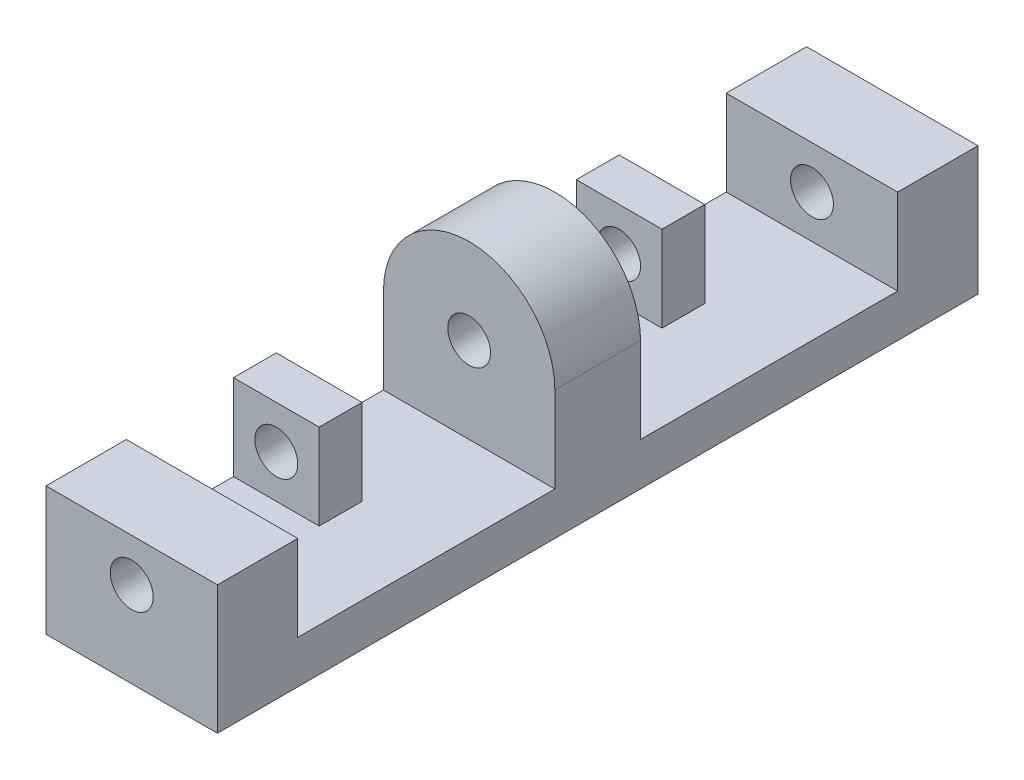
ISO-10303-21;
HEADER;
FILE_DESCRIPTION(('STEP AP214'),'2;1');
FILE_NAME('part.step','',(''),(''),'','','');
FILE_SCHEMA(('AUTOMOTIVE_DESIGN { 1 0 10303 214 1 1 1 1 }'));
ENDSEC;
DATA;
#1=APPLICATION_CONTEXT('core data for automotive mechanical design processes');
#2=APPLICATION_PROTOCOL_DEFINITION('international standard','automotive_design',2000,#1);
#3=PRODUCT_CONTEXT('',#1,'mechanical');
#4=PRODUCT('Part','Part','',(#3));
#5=PRODUCT_RELATED_PRODUCT_CATEGORY('part','',(#4));
#6=PRODUCT_DEFINITION_FORMATION('','',#4);
#7=PRODUCT_DEFINITION_CONTEXT('part definition',#1,'design');
#8=PRODUCT_DEFINITION('design','',#6,#7);
#9=PRODUCT_DEFINITION_SHAPE('','',#8);
#10=(LENGTH_UNIT() NAMED_UNIT(*) SI_UNIT(.MILLI.,.METRE.));
#11=(NAMED_UNIT(*) PLANE_ANGLE_UNIT() SI_UNIT($,.RADIAN.));
#12=(NAMED_UNIT(*) SI_UNIT($,.STERADIAN.) SOLID_ANGLE_UNIT());
#13=UNCERTAINTY_MEASURE_WITH_UNIT(LENGTH_MEASURE(1.E-05),#10,'distance_accuracy_value','');
#14=(GEOMETRIC_REPRESENTATION_CONTEXT(3) GLOBAL_UNCERTAINTY_ASSIGNED_CONTEXT((#13)) GLOBAL_UNIT_ASSIGNED_CONTEXT((#10,
#11,#12)) REPRESENTATION_CONTEXT('',''));
#15=CARTESIAN_POINT('',(0.,0.,0.));
#16=DIRECTION('',(0.,0.,1.));
#17=DIRECTION('',(1.,0.,0.));
#18=AXIS2_PLACEMENT_3D('',#15,#16,#17);
#19=CARTESIAN_POINT('',(0.,12.7,201.6125));
#20=DIRECTION('',(0.,-1.,0.));
#21=DIRECTION('',(0.,0.,-1.));
#22=AXIS2_PLACEMENT_3D('',#19,#20,#21);
#23=PLANE('',#22);
#24=DIRECTION('',(-1.,0.,0.));
#25=VECTOR('',#24,1.);
#26=CARTESIAN_POINT('',(25.4,12.7,169.8625));
#27=LINE('',#26,#25);
#28=CARTESIAN_POINT('',(25.4,12.7,169.8625));
#29=VERTEX_POINT('',#28);
#30=CARTESIAN_POINT('',(0.,12.7,169.8625));
#31=VERTEX_POINT('',#30);
#32=EDGE_CURVE('E195',#29,#31,#27,.T.);
#33=ORIENTED_EDGE('',*,*,#32,.T.);
#34=DIRECTION('',(0.,0.,-1.));
#35=VECTOR('',#34,1.);
#36=CARTESIAN_POINT('',(0.,12.7,201.6125));
#37=LINE('',#36,#35);
#38=CARTESIAN_POINT('',(0.,12.7,201.6125));
#39=VERTEX_POINT('',#38);
#40=EDGE_CURVE('E299',#39,#31,#37,.T.);
#41=ORIENTED_EDGE('',*,*,#40,.F.);
#42=DIRECTION('',(1.,0.,0.));
#43=VECTOR('',#42,1.);
#44=CARTESIAN_POINT('',(0.,12.7,201.6125));
#45=LINE('',#44,#43);
#46=CARTESIAN_POINT('',(50.8,12.7,201.6125));
#47=VERTEX_POINT('',#46);
#48=EDGE_CURVE('E310',#39,#47,#45,.T.);
#49=ORIENTED_EDGE('',*,*,#48,.T.);
#50=DIRECTION('',(0.,0.,-1.));
#51=VECTOR('',#50,1.);
#52=CARTESIAN_POINT('',(50.8,12.7,201.6125));
#53=LINE('',#52,#51);
#54=CARTESIAN_POINT('',(50.8,12.7,125.4125));
#55=VERTEX_POINT('',#54);
#56=EDGE_CURVE('E311',#47,#55,#53,.T.);
#57=ORIENTED_EDGE('',*,*,#56,.T.);
#58=DIRECTION('',(1.,0.,0.));
#59=VECTOR('',#58,1.);
#60=CARTESIAN_POINT('',(50.8,12.7,125.4125));
#61=LINE('',#60,#59);
#62=CARTESIAN_POINT('',(0.,12.7,125.4125));
#63=VERTEX_POINT('',#62);
#64=EDGE_CURVE('E275',#63,#55,#61,.T.);
#65=ORIENTED_EDGE('',*,*,#64,.F.);
#66=CARTESIAN_POINT('',(0.,12.7,157.1625));
#67=VERTEX_POINT('',#66);
#68=EDGE_CURVE('E303',#67,#63,#37,.T.);
#69=ORIENTED_EDGE('',*,*,#68,.F.);
#70=DIRECTION('',(-1.,0.,0.));
#71=VECTOR('',#70,1.);
#72=CARTESIAN_POINT('',(25.4,12.7,157.1625));
#73=LINE('',#72,#71);
#74=CARTESIAN_POINT('',(25.4,12.7,157.1625));
#75=VERTEX_POINT('',#74);
#76=EDGE_CURVE('E217',#75,#67,#73,.T.);
#77=ORIENTED_EDGE('',*,*,#76,.F.);
#78=DIRECTION('',(0.,0.,-1.));
#79=VECTOR('',#78,1.);
#80=CARTESIAN_POINT('',(25.4,12.7,169.8625));
#81=LINE('',#80,#79);
#82=EDGE_CURVE('E199',#29,#75,#81,.T.);
#83=ORIENTED_EDGE('',*,*,#82,.F.);
#84=EDGE_LOOP('',(#33,#41,#49,#57,#65,#69,#77,#83));
#85=FACE_BOUND('',#84,.T.);
#86=ADVANCED_FACE('F43',(#85),#23,.F.);
#87=DIRECTION('',(-1.,0.,0.));
#88=VECTOR('',#87,1.);
#89=CARTESIAN_POINT('',(25.4,12.7,68.2625));
#90=LINE('',#89,#88);
#91=CARTESIAN_POINT('',(25.4,12.7,68.2625));
#92=VERTEX_POINT('',#91);
#93=CARTESIAN_POINT('',(0.,12.7,68.2625));
#94=VERTEX_POINT('',#93);
#95=EDGE_CURVE('E250',#92,#94,#90,.T.);
#96=ORIENTED_EDGE('',*,*,#95,.T.);
#97=CARTESIAN_POINT('',(0.,12.7,100.0125));
#98=VERTEX_POINT('',#97);
#99=EDGE_CURVE('E302',#98,#94,#37,.T.);
#100=ORIENTED_EDGE('',*,*,#99,.F.);
#101=DIRECTION('',(-1.,0.,0.));
#102=VECTOR('',#101,1.);
#103=CARTESIAN_POINT('',(50.8,12.7,100.0125));
#104=LINE('',#103,#102);
#105=CARTESIAN_POINT('',(50.8,12.7,100.0125));
#106=VERTEX_POINT('',#105);
#107=EDGE_CURVE('E269',#106,#98,#104,.T.);
#108=ORIENTED_EDGE('',*,*,#107,.F.);
#109=CARTESIAN_POINT('',(50.8,12.7,23.8125));
#110=VERTEX_POINT('',#109);
#111=EDGE_CURVE('E309',#106,#110,#53,.T.);
#112=ORIENTED_EDGE('',*,*,#111,.T.);
#113=DIRECTION('',(1.,0.,0.));
#114=VECTOR('',#113,1.);
#115=CARTESIAN_POINT('',(0.,12.7,23.8125));
#116=LINE('',#115,#114);
#117=CARTESIAN_POINT('',(0.,12.7,23.8125));
#118=VERTEX_POINT('',#117);
#119=EDGE_CURVE('E322',#118,#110,#116,.T.);
#120=ORIENTED_EDGE('',*,*,#119,.F.);
#121=CARTESIAN_POINT('',(0.,12.7,55.5625));
#122=VERTEX_POINT('',#121);
#123=EDGE_CURVE('E300',#122,#118,#37,.T.);
#124=ORIENTED_EDGE('',*,*,#123,.F.);
#125=DIRECTION('',(-1.,0.,0.));
#126=VECTOR('',#125,1.);
#127=CARTESIAN_POINT('',(25.4,12.7,55.5625));
#128=LINE('',#127,#126);
#129=CARTESIAN_POINT('',(25.4,12.7,55.5625));
#130=VERTEX_POINT('',#129);
#131=EDGE_CURVE('E244',#130,#122,#128,.T.);
#132=ORIENTED_EDGE('',*,*,#131,.F.);
#133=DIRECTION('',(0.,0.,1.));
#134=VECTOR('',#133,1.);
#135=CARTESIAN_POINT('',(25.4,12.7,55.5625));
#136=LINE('',#135,#134);
#137=EDGE_CURVE('E235',#130,#92,#136,.T.);
#138=ORIENTED_EDGE('',*,*,#137,.T.);
#139=EDGE_LOOP('',(#96,#100,#108,#112,#120,#124,#132,#138));
#140=FACE_BOUND('',#139,.T.);
#141=ADVANCED_FACE('F380',(#140),#23,.F.);
#142=CARTESIAN_POINT('',(50.8,0.,225.425));
#143=DIRECTION('',(-1.,0.,0.));
#144=DIRECTION('',(0.,0.,1.));
#145=AXIS2_PLACEMENT_3D('',#142,#143,#144);
#146=PLANE('',#145);
#147=DIRECTION('',(0.,0.,1.));
#148=VECTOR('',#147,1.);
#149=CARTESIAN_POINT('',(50.8,38.1,-199.542692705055));
#150=LINE('',#149,#148);
#151=CARTESIAN_POINT('',(50.8,38.1,100.0125));
#152=VERTEX_POINT('',#151);
#153=CARTESIAN_POINT('',(50.8,38.1,125.4125));
#154=VERTEX_POINT('',#153);
#155=EDGE_CURVE('E251',#152,#154,#150,.T.);
#156=ORIENTED_EDGE('',*,*,#155,.T.);
#157=DIRECTION('',(0.,-1.,0.));
#158=VECTOR('',#157,1.);
#159=CARTESIAN_POINT('',(50.8,63.5,125.4125));
#160=LINE('',#159,#158);
#161=EDGE_CURVE('E273',#154,#55,#160,.T.);
#162=ORIENTED_EDGE('',*,*,#161,.T.);
#163=ORIENTED_EDGE('',*,*,#56,.F.);
#164=DIRECTION('',(0.,-1.,0.));
#165=VECTOR('',#164,1.);
#166=CARTESIAN_POINT('',(50.8,38.1,201.6125));
#167=LINE('',#166,#165);
#168=CARTESIAN_POINT('',(50.8,38.1,201.6125));
#169=VERTEX_POINT('',#168);
#170=EDGE_CURVE('E291',#169,#47,#167,.T.);
#171=ORIENTED_EDGE('',*,*,#170,.F.);
#172=DIRECTION('',(0.,0.,-1.));
#173=VECTOR('',#172,1.);
#174=CARTESIAN_POINT('',(50.8,38.1,225.425));
#175=LINE('',#174,#173);
#176=CARTESIAN_POINT('',(50.8,38.1,225.425));
#177=VERTEX_POINT('',#176);
#178=EDGE_CURVE('E348',#177,#169,#175,.T.);
#179=ORIENTED_EDGE('',*,*,#178,.F.);
#180=DIRECTION('',(0.,1.,0.));
#181=VECTOR('',#180,1.);
#182=CARTESIAN_POINT('',(50.8,0.,225.425));
#183=LINE('',#182,#181);
#184=CARTESIAN_POINT('',(50.8,0.,225.425));
#185=VERTEX_POINT('',#184);
#186=EDGE_CURVE('E333',#185,#177,#183,.T.);
#187=ORIENTED_EDGE('',*,*,#186,.F.);
#188=DIRECTION('',(0.,0.,-1.));
#189=VECTOR('',#188,1.);
#190=CARTESIAN_POINT('',(50.8,0.,225.425));
#191=LINE('',#190,#189);
#192=CARTESIAN_POINT('',(50.8,0.,0.));
#193=VERTEX_POINT('',#192);
#194=EDGE_CURVE('E55',#185,#193,#191,.T.);
#195=ORIENTED_EDGE('',*,*,#194,.T.);
#196=DIRECTION('',(0.,1.,0.));
#197=VECTOR('',#196,1.);
#198=CARTESIAN_POINT('',(50.8,0.,0.));
#199=LINE('',#198,#197);
#200=CARTESIAN_POINT('',(50.8,38.1,0.));
#201=VERTEX_POINT('',#200);
#202=EDGE_CURVE('E338',#193,#201,#199,.T.);
#203=ORIENTED_EDGE('',*,*,#202,.T.);
#204=CARTESIAN_POINT('',(50.8,38.1,23.8125));
#205=VERTEX_POINT('',#204);
#206=EDGE_CURVE('E347',#205,#201,#175,.T.);
#207=ORIENTED_EDGE('',*,*,#206,.F.);
#208=DIRECTION('',(0.,1.,0.));
#209=VECTOR('',#208,1.);
#210=CARTESIAN_POINT('',(50.8,38.1,23.8125));
#211=LINE('',#210,#209);
#212=EDGE_CURVE('E296',#110,#205,#211,.T.);
#213=ORIENTED_EDGE('',*,*,#212,.F.);
#214=ORIENTED_EDGE('',*,*,#111,.F.);
#215=DIRECTION('',(0.,-1.,0.));
#216=VECTOR('',#215,1.);
#217=CARTESIAN_POINT('',(50.8,63.5,100.0125));
#218=LINE('',#217,#216);
#219=EDGE_CURVE('E285',#152,#106,#218,.T.);
#220=ORIENTED_EDGE('',*,*,#219,.F.);
#221=EDGE_LOOP('',(#156,#162,#163,#171,#179,#187,#195,#203,#207,#213,#214,#220));
#222=FACE_BOUND('',#221,.T.);
#223=ADVANCED_FACE('F357',(#222),#146,.F.);
#224=CARTESIAN_POINT('',(0.,38.1,225.425));
#225=DIRECTION('',(0.,-1.,0.));
#226=DIRECTION('',(0.,0.,-1.));
#227=AXIS2_PLACEMENT_3D('',#224,#225,#226);
#228=PLANE('',#227);
#229=ORIENTED_EDGE('',*,*,#178,.T.);
#230=DIRECTION('',(1.,0.,0.));
#231=VECTOR('',#230,1.);
#232=CARTESIAN_POINT('',(0.,38.1,201.6125));
#233=LINE('',#232,#231);
#234=CARTESIAN_POINT('',(0.,38.1,201.6125));
#235=VERTEX_POINT('',#234);
#236=EDGE_CURVE('E314',#235,#169,#233,.T.);
#237=ORIENTED_EDGE('',*,*,#236,.F.);
#238=DIRECTION('',(0.,0.,-1.));
#239=VECTOR('',#238,1.);
#240=CARTESIAN_POINT('',(0.,38.1,225.425));
#241=LINE('',#240,#239);
#242=CARTESIAN_POINT('',(0.,38.1,225.425));
#243=VERTEX_POINT('',#242);
#244=EDGE_CURVE('E343',#243,#235,#241,.T.);
#245=ORIENTED_EDGE('',*,*,#244,.F.);
#246=DIRECTION('',(-1.,0.,0.));
#247=VECTOR('',#246,1.);
#248=CARTESIAN_POINT('',(0.,38.1,225.425));
#249=LINE('',#248,#247);
#250=EDGE_CURVE('E331',#177,#243,#249,.T.);
#251=ORIENTED_EDGE('',*,*,#250,.F.);
#252=EDGE_LOOP('',(#229,#237,#245,#251));
#253=FACE_BOUND('',#252,.T.);
#254=ADVANCED_FACE('F405',(#253),#228,.F.);
#255=CARTESIAN_POINT('',(0.,0.,225.425));
#256=DIRECTION('',(1.,0.,0.));
#257=DIRECTION('',(0.,0.,-1.));
#258=AXIS2_PLACEMENT_3D('',#255,#256,#257);
#259=PLANE('',#258);
#260=DIRECTION('',(0.,-1.,0.));
#261=VECTOR('',#260,1.);
#262=CARTESIAN_POINT('',(0.,63.5,125.4125));
#263=LINE('',#262,#261);
#264=CARTESIAN_POINT('',(0.,38.1,125.4125));
#265=VERTEX_POINT('',#264);
#266=EDGE_CURVE('E280',#265,#63,#263,.T.);
#267=ORIENTED_EDGE('',*,*,#266,.F.);
#268=DIRECTION('',(0.,0.,1.));
#269=VECTOR('',#268,1.);
#270=CARTESIAN_POINT('',(0.,38.1,-199.542692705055));
#271=LINE('',#270,#269);
#272=CARTESIAN_POINT('',(0.,38.1,100.0125));
#273=VERTEX_POINT('',#272);
#274=EDGE_CURVE('E254',#273,#265,#271,.T.);
#275=ORIENTED_EDGE('',*,*,#274,.F.);
#276=DIRECTION('',(0.,-1.,0.));
#277=VECTOR('',#276,1.);
#278=CARTESIAN_POINT('',(0.,63.5,100.0125));
#279=LINE('',#278,#277);
#280=EDGE_CURVE('E278',#273,#98,#279,.T.);
#281=ORIENTED_EDGE('',*,*,#280,.T.);
#282=ORIENTED_EDGE('',*,*,#99,.T.);
#283=DIRECTION('',(0.,-1.,0.));
#284=VECTOR('',#283,1.);
#285=CARTESIAN_POINT('',(0.,38.1,68.2625));
#286=LINE('',#285,#284);
#287=CARTESIAN_POINT('',(0.,38.1,68.2625));
#288=VERTEX_POINT('',#287);
#289=EDGE_CURVE('E241',#288,#94,#286,.T.);
#290=ORIENTED_EDGE('',*,*,#289,.F.);
#291=DIRECTION('',(0.,0.,1.));
#292=VECTOR('',#291,1.);
#293=CARTESIAN_POINT('',(0.,38.1,55.5625));
#294=LINE('',#293,#292);
#295=CARTESIAN_POINT('',(0.,38.1,55.5625));
#296=VERTEX_POINT('',#295);
#297=EDGE_CURVE('E228',#296,#288,#294,.T.);
#298=ORIENTED_EDGE('',*,*,#297,.F.);
#299=DIRECTION('',(0.,-1.,0.));
#300=VECTOR('',#299,1.);
#301=CARTESIAN_POINT('',(0.,38.1,55.5625));
#302=LINE('',#301,#300);
#303=EDGE_CURVE('E66',#296,#122,#302,.T.);
#304=ORIENTED_EDGE('',*,*,#303,.T.);
#305=ORIENTED_EDGE('',*,*,#123,.T.);
#306=DIRECTION('',(0.,1.,0.));
#307=VECTOR('',#306,1.);
#308=CARTESIAN_POINT('',(0.,38.1,23.8125));
#309=LINE('',#308,#307);
#310=CARTESIAN_POINT('',(0.,38.1,23.8125));
#311=VERTEX_POINT('',#310);
#312=EDGE_CURVE('E305',#118,#311,#309,.T.);
#313=ORIENTED_EDGE('',*,*,#312,.T.);
#314=CARTESIAN_POINT('',(0.,38.1,0.));
#315=VERTEX_POINT('',#314);
#316=EDGE_CURVE('E332',#311,#315,#241,.T.);
#317=ORIENTED_EDGE('',*,*,#316,.T.);
#318=DIRECTION('',(0.,-1.,0.));
#319=VECTOR('',#318,1.);
#320=CARTESIAN_POINT('',(0.,0.,0.));
#321=LINE('',#320,#319);
#322=CARTESIAN_POINT('',(0.,0.,0.));
#323=VERTEX_POINT('',#322);
#324=EDGE_CURVE('E320',#315,#323,#321,.T.);
#325=ORIENTED_EDGE('',*,*,#324,.T.);
#326=DIRECTION('',(0.,0.,-1.));
#327=VECTOR('',#326,1.);
#328=CARTESIAN_POINT('',(0.,0.,225.425));
#329=LINE('',#328,#327);
#330=CARTESIAN_POINT('',(0.,0.,225.425));
#331=VERTEX_POINT('',#330);
#332=EDGE_CURVE('E11',#331,#323,#329,.T.);
#333=ORIENTED_EDGE('',*,*,#332,.F.);
#334=DIRECTION('',(0.,-1.,0.));
#335=VECTOR('',#334,1.);
#336=CARTESIAN_POINT('',(0.,0.,225.425));
#337=LINE('',#336,#335);
#338=EDGE_CURVE('E323',#243,#331,#337,.T.);
#339=ORIENTED_EDGE('',*,*,#338,.F.);
#340=ORIENTED_EDGE('',*,*,#244,.T.);
#341=DIRECTION('',(0.,-1.,0.));
#342=VECTOR('',#341,1.);
#343=CARTESIAN_POINT('',(0.,38.1,201.6125));
#344=LINE('',#343,#342);
#345=EDGE_CURVE('E295',#235,#39,#344,.T.);
#346=ORIENTED_EDGE('',*,*,#345,.T.);
#347=ORIENTED_EDGE('',*,*,#40,.T.);
#348=DIRECTION('',(0.,-1.,0.));
#349=VECTOR('',#348,1.);
#350=CARTESIAN_POINT('',(0.,38.1,169.8625));
#351=LINE('',#350,#349);
#352=CARTESIAN_POINT('',(0.,38.1,169.8625));
#353=VERTEX_POINT('',#352);
#354=EDGE_CURVE('E207',#353,#31,#351,.T.);
#355=ORIENTED_EDGE('',*,*,#354,.F.);
#356=DIRECTION('',(0.,0.,-1.));
#357=VECTOR('',#356,1.);
#358=CARTESIAN_POINT('',(0.,38.1,169.8625));
#359=LINE('',#358,#357);
#360=CARTESIAN_POINT('',(0.,38.1,157.1625));
#361=VERTEX_POINT('',#360);
#362=EDGE_CURVE('E189',#353,#361,#359,.T.);
#363=ORIENTED_EDGE('',*,*,#362,.T.);
#364=DIRECTION('',(0.,-1.,0.));
#365=VECTOR('',#364,1.);
#366=CARTESIAN_POINT('',(0.,38.1,157.1625));
#367=LINE('',#366,#365);
#368=EDGE_CURVE('E56',#361,#67,#367,.T.);
#369=ORIENTED_EDGE('',*,*,#368,.T.);
#370=ORIENTED_EDGE('',*,*,#68,.T.);
#371=EDGE_LOOP('',(#267,#275,#281,#282,#290,#298,#304,#305,#313,#317,#325,#333,#339,#340,#346,
#347,#355,#363,#369,#370));
#372=FACE_BOUND('',#371,.T.);
#373=ADVANCED_FACE('F44',(#372),#259,.F.);
#374=CARTESIAN_POINT('',(0.,0.,225.425));
#375=DIRECTION('',(0.,1.,0.));
#376=DIRECTION('',(0.,0.,1.));
#377=AXIS2_PLACEMENT_3D('',#374,#375,#376);
#378=PLANE('',#377);
#379=DIRECTION('',(1.,0.,0.));
#380=VECTOR('',#379,1.);
#381=CARTESIAN_POINT('',(0.,0.,0.));
#382=LINE('',#381,#380);
#383=EDGE_CURVE('E336',#323,#193,#382,.T.);
#384=ORIENTED_EDGE('',*,*,#383,.T.);
#385=ORIENTED_EDGE('',*,*,#194,.F.);
#386=DIRECTION('',(1.,0.,0.));
#387=VECTOR('',#386,1.);
#388=CARTESIAN_POINT('',(0.,0.,225.425));
#389=LINE('',#388,#387);
#390=EDGE_CURVE('E327',#331,#185,#389,.T.);
#391=ORIENTED_EDGE('',*,*,#390,.F.);
#392=ORIENTED_EDGE('',*,*,#332,.T.);
#393=EDGE_LOOP('',(#384,#385,#391,#392));
#394=FACE_BOUND('',#393,.T.);
#395=ADVANCED_FACE('F409',(#394),#378,.F.);
#396=ORIENTED_EDGE('',*,*,#316,.F.);
#397=DIRECTION('',(1.,0.,0.));
#398=VECTOR('',#397,1.);
#399=CARTESIAN_POINT('',(0.,38.1,23.8125));
#400=LINE('',#399,#398);
#401=EDGE_CURVE('E319',#311,#205,#400,.T.);
#402=ORIENTED_EDGE('',*,*,#401,.T.);
#403=ORIENTED_EDGE('',*,*,#206,.T.);
#404=DIRECTION('',(-1.,0.,0.));
#405=VECTOR('',#404,1.);
#406=CARTESIAN_POINT('',(0.,38.1,0.));
#407=LINE('',#406,#405);
#408=EDGE_CURVE('E328',#201,#315,#407,.T.);
#409=ORIENTED_EDGE('',*,*,#408,.T.);
#410=EDGE_LOOP('',(#396,#402,#403,#409));
#411=FACE_BOUND('',#410,.T.);
#412=ADVANCED_FACE('F370',(#411),#228,.F.);
#413=CARTESIAN_POINT('',(0.,38.1,225.425));
#414=DIRECTION('',(0.,0.,-1.));
#415=DIRECTION('',(-1.,0.,0.));
#416=AXIS2_PLACEMENT_3D('',#413,#414,#415);
#417=PLANE('',#416);
#418=CARTESIAN_POINT('',(25.4,25.4,225.425));
#419=DIRECTION('',(0.,0.,1.));
#420=DIRECTION('',(1.,0.,0.));
#421=AXIS2_PLACEMENT_3D('',#418,#419,#420);
#422=CIRCLE('',#421,6.35);
#423=CARTESIAN_POINT('',(31.75,25.4,225.425));
#424=VERTEX_POINT('',#423);
#425=EDGE_CURVE('E283',#424,#424,#422,.T.);
#426=ORIENTED_EDGE('',*,*,#425,.F.);
#427=EDGE_LOOP('',(#426));
#428=FACE_BOUND('',#427,.T.);
#429=ORIENTED_EDGE('',*,*,#338,.T.);
#430=ORIENTED_EDGE('',*,*,#390,.T.);
#431=ORIENTED_EDGE('',*,*,#186,.T.);
#432=ORIENTED_EDGE('',*,*,#250,.T.);
#433=EDGE_LOOP('',(#429,#430,#431,#432));
#434=FACE_BOUND('',#433,.T.);
#435=ADVANCED_FACE('F407',(#428,#434),#417,.F.);
#436=CARTESIAN_POINT('',(0.,38.1,0.));
#437=DIRECTION('',(0.,0.,-1.));
#438=DIRECTION('',(-1.,0.,0.));
#439=AXIS2_PLACEMENT_3D('',#436,#437,#438);
#440=PLANE('',#439);
#441=CARTESIAN_POINT('',(25.4,25.4,0.));
#442=DIRECTION('',(0.,0.,1.));
#443=DIRECTION('',(1.,0.,0.));
#444=AXIS2_PLACEMENT_3D('',#441,#442,#443);
#445=CIRCLE('',#444,6.35);
#446=CARTESIAN_POINT('',(31.75,25.4,0.));
#447=VERTEX_POINT('',#446);
#448=EDGE_CURVE('E284',#447,#447,#445,.T.);
#449=ORIENTED_EDGE('',*,*,#448,.T.);
#450=EDGE_LOOP('',(#449));
#451=FACE_BOUND('',#450,.T.);
#452=ORIENTED_EDGE('',*,*,#324,.F.);
#453=ORIENTED_EDGE('',*,*,#408,.F.);
#454=ORIENTED_EDGE('',*,*,#202,.F.);
#455=ORIENTED_EDGE('',*,*,#383,.F.);
#456=EDGE_LOOP('',(#452,#453,#454,#455));
#457=FACE_BOUND('',#456,.T.);
#458=ADVANCED_FACE('F364',(#451,#457),#440,.T.);
#459=CARTESIAN_POINT('',(0.,38.1,201.6125));
#460=DIRECTION('',(0.,0.,1.));
#461=DIRECTION('',(1.,0.,0.));
#462=AXIS2_PLACEMENT_3D('',#459,#460,#461);
#463=PLANE('',#462);
#464=CARTESIAN_POINT('',(25.4,25.4,201.6125));
#465=DIRECTION('',(0.,0.,1.));
#466=DIRECTION('',(1.,0.,0.));
#467=AXIS2_PLACEMENT_3D('',#464,#465,#466);
#468=CIRCLE('',#467,6.35);
#469=CARTESIAN_POINT('',(31.75,25.4,201.6125));
#470=VERTEX_POINT('',#469);
#471=EDGE_CURVE('E287',#470,#470,#468,.T.);
#472=ORIENTED_EDGE('',*,*,#471,.T.);
#473=EDGE_LOOP('',(#472));
#474=FACE_BOUND('',#473,.T.);
#475=ORIENTED_EDGE('',*,*,#170,.T.);
#476=ORIENTED_EDGE('',*,*,#48,.F.);
#477=ORIENTED_EDGE('',*,*,#345,.F.);
#478=ORIENTED_EDGE('',*,*,#236,.T.);
#479=EDGE_LOOP('',(#475,#476,#477,#478));
#480=FACE_BOUND('',#479,.T.);
#481=ADVANCED_FACE('F434',(#474,#480),#463,.F.);
#482=CARTESIAN_POINT('',(0.,38.1,23.8125));
#483=DIRECTION('',(0.,0.,-1.));
#484=DIRECTION('',(-1.,0.,0.));
#485=AXIS2_PLACEMENT_3D('',#482,#483,#484);
#486=PLANE('',#485);
#487=CARTESIAN_POINT('',(25.4,25.4,23.8125));
#488=DIRECTION('',(0.,0.,-1.));
#489=DIRECTION('',(-1.,0.,0.));
#490=AXIS2_PLACEMENT_3D('',#487,#488,#489);
#491=CIRCLE('',#490,6.35);
#492=CARTESIAN_POINT('',(31.75,25.4,23.8125));
#493=VERTEX_POINT('',#492);
#494=EDGE_CURVE('E50',#493,#493,#491,.T.);
#495=ORIENTED_EDGE('',*,*,#494,.T.);
#496=EDGE_LOOP('',(#495));
#497=FACE_BOUND('',#496,.T.);
#498=ORIENTED_EDGE('',*,*,#212,.T.);
#499=ORIENTED_EDGE('',*,*,#401,.F.);
#500=ORIENTED_EDGE('',*,*,#312,.F.);
#501=ORIENTED_EDGE('',*,*,#119,.T.);
#502=EDGE_LOOP('',(#498,#499,#500,#501));
#503=FACE_BOUND('',#502,.T.);
#504=ADVANCED_FACE('F375',(#497,#503),#486,.F.);
#505=CARTESIAN_POINT('',(25.4,25.4,0.));
#506=DIRECTION('',(0.,0.,1.));
#507=DIRECTION('',(1.,0.,0.));
#508=AXIS2_PLACEMENT_3D('',#505,#506,#507);
#509=CYLINDRICAL_SURFACE('',#508,6.35);
#510=CARTESIAN_POINT('',(31.75,25.4,0.));
#511=CARTESIAN_POINT('',(31.75,25.4,0.248046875));
#512=CARTESIAN_POINT('',(31.75,25.4,0.49609375));
#513=CARTESIAN_POINT('',(31.75,25.4,0.9921875));
#514=CARTESIAN_POINT('',(31.75,25.4,1.240234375));
#515=CARTESIAN_POINT('',(31.75,25.4,1.736328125));
#516=CARTESIAN_POINT('',(31.75,25.4,1.984375));
#517=CARTESIAN_POINT('',(31.75,25.4,2.48046875));
#518=CARTESIAN_POINT('',(31.75,25.4,2.728515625));
#519=CARTESIAN_POINT('',(31.75,25.4,3.224609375));
#520=CARTESIAN_POINT('',(31.75,25.4,3.47265625));
#521=CARTESIAN_POINT('',(31.75,25.4,3.96875));
#522=CARTESIAN_POINT('',(31.75,25.4,4.216796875));
#523=CARTESIAN_POINT('',(31.75,25.4,4.712890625));
#524=CARTESIAN_POINT('',(31.75,25.4,4.9609375));
#525=CARTESIAN_POINT('',(31.75,25.4,5.45703125));
#526=CARTESIAN_POINT('',(31.75,25.4,5.705078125));
#527=CARTESIAN_POINT('',(31.75,25.4,6.201171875));
#528=CARTESIAN_POINT('',(31.75,25.4,6.44921875));
#529=CARTESIAN_POINT('',(31.75,25.4,6.9453125));
#530=CARTESIAN_POINT('',(31.75,25.4,7.193359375));
#531=CARTESIAN_POINT('',(31.75,25.4,7.689453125));
#532=CARTESIAN_POINT('',(31.75,25.4,7.9375));
#533=CARTESIAN_POINT('',(31.75,25.4,8.43359375));
#534=CARTESIAN_POINT('',(31.75,25.4,8.681640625));
#535=CARTESIAN_POINT('',(31.75,25.4,9.177734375));
#536=CARTESIAN_POINT('',(31.75,25.4,9.42578125));
#537=CARTESIAN_POINT('',(31.75,25.4,9.92187499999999));
#538=CARTESIAN_POINT('',(31.75,25.4,10.169921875));
#539=CARTESIAN_POINT('',(31.75,25.4,10.666015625));
#540=CARTESIAN_POINT('',(31.75,25.4,10.9140625));
#541=CARTESIAN_POINT('',(31.75,25.4,11.41015625));
#542=CARTESIAN_POINT('',(31.75,25.4,11.658203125));
#543=CARTESIAN_POINT('',(31.75,25.4,12.154296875));
#544=CARTESIAN_POINT('',(31.75,25.4,12.40234375));
#545=CARTESIAN_POINT('',(31.75,25.4,12.8984375));
#546=CARTESIAN_POINT('',(31.75,25.4,13.146484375));
#547=CARTESIAN_POINT('',(31.75,25.4,13.642578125));
#548=CARTESIAN_POINT('',(31.75,25.4,13.890625));
#549=CARTESIAN_POINT('',(31.75,25.4,14.38671875));
#550=CARTESIAN_POINT('',(31.75,25.4,14.634765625));
#551=CARTESIAN_POINT('',(31.75,25.4,15.130859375));
#552=CARTESIAN_POINT('',(31.75,25.4,15.37890625));
#553=CARTESIAN_POINT('',(31.75,25.4,15.875));
#554=CARTESIAN_POINT('',(31.75,25.4,16.123046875));
#555=CARTESIAN_POINT('',(31.75,25.4,16.619140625));
#556=CARTESIAN_POINT('',(31.75,25.4,16.8671875));
#557=CARTESIAN_POINT('',(31.75,25.4,17.36328125));
#558=CARTESIAN_POINT('',(31.75,25.4,17.611328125));
#559=CARTESIAN_POINT('',(31.75,25.4,18.107421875));
#560=CARTESIAN_POINT('',(31.75,25.4,18.35546875));
#561=CARTESIAN_POINT('',(31.75,25.4,18.8515625));
#562=CARTESIAN_POINT('',(31.75,25.4,19.099609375));
#563=CARTESIAN_POINT('',(31.75,25.4,19.595703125));
#564=CARTESIAN_POINT('',(31.75,25.4,19.84375));
#565=CARTESIAN_POINT('',(31.75,25.4,20.33984375));
#566=CARTESIAN_POINT('',(31.75,25.4,20.587890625));
#567=CARTESIAN_POINT('',(31.75,25.4,21.083984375));
#568=CARTESIAN_POINT('',(31.75,25.4,21.33203125));
#569=CARTESIAN_POINT('',(31.75,25.4,21.828125));
#570=CARTESIAN_POINT('',(31.75,25.4,22.076171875));
#571=CARTESIAN_POINT('',(31.75,25.4,22.572265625));
#572=CARTESIAN_POINT('',(31.75,25.4,22.8203125));
#573=CARTESIAN_POINT('',(31.75,25.4,23.31640625));
#574=CARTESIAN_POINT('',(31.75,25.4,23.564453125));
#575=CARTESIAN_POINT('',(31.75,25.4,23.8125));
#576=B_SPLINE_CURVE_WITH_KNOTS('',3,(#510,#511,#512,#513,#514,#515,#516,#517,#518,#519,#520,
#521,#522,#523,#524,#525,#526,#527,#528,#529,#530,#531,#532,#533,#534,#535,#536,#537,#538,#539,
#540,#541,#542,#543,#544,#545,#546,#547,#548,#549,#550,#551,#552,#553,#554,#555,#556,#557,#558,
#559,#560,#561,#562,#563,#564,#565,#566,#567,#568,#569,#570,#571,#572,#573,#574,#575),
.UNSPECIFIED.,.F.,.F.,(4,2,2,2,2,2,2,2,2,2,2,2,2,2,2,2,2,2,2,2,2,2,2,2,2,2,2,2,2,2,2,2,4),(0.,
0.744140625,1.48828125,2.232421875,2.9765625,3.720703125,4.46484375,5.208984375,5.953125,
6.697265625,7.44140625,8.185546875,8.9296875,9.67382812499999,10.41796875,11.162109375,11.90625,
12.650390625,13.39453125,14.138671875,14.8828125,15.626953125,16.37109375,17.115234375,
17.859375,18.603515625,19.34765625,20.091796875,20.8359375,21.580078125,22.32421875,
23.068359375,23.8125),.UNSPECIFIED.);
#577=EDGE_CURVE('BSEAM481',#447,#493,#576,.T.);
#578=ORIENTED_EDGE('',*,*,#448,.F.);
#579=ORIENTED_EDGE('',*,*,#494,.F.);
#580=ORIENTED_EDGE('',*,*,#577,.T.);
#581=ORIENTED_EDGE('',*,*,#577,.F.);
#582=EDGE_LOOP('',(#578,#580,#579,#581));
#583=FACE_BOUND('',#582,.T.);
#584=ADVANCED_FACE('F481',(#583),#509,.F.);
#585=CARTESIAN_POINT('',(31.75,25.4,225.425));
#586=CARTESIAN_POINT('',(31.75,25.4,225.176953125));
#587=CARTESIAN_POINT('',(31.75,25.4,224.92890625));
#588=CARTESIAN_POINT('',(31.75,25.4,224.4328125));
#589=CARTESIAN_POINT('',(31.75,25.4,224.184765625));
#590=CARTESIAN_POINT('',(31.75,25.4,223.688671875));
#591=CARTESIAN_POINT('',(31.75,25.4,223.440625));
#592=CARTESIAN_POINT('',(31.75,25.4,222.94453125));
#593=CARTESIAN_POINT('',(31.75,25.4,222.696484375));
#594=CARTESIAN_POINT('',(31.75,25.4,222.200390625));
#595=CARTESIAN_POINT('',(31.75,25.4,221.95234375));
#596=CARTESIAN_POINT('',(31.75,25.4,221.45625));
#597=CARTESIAN_POINT('',(31.75,25.4,221.208203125));
#598=CARTESIAN_POINT('',(31.75,25.4,220.712109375));
#599=CARTESIAN_POINT('',(31.75,25.4,220.4640625));
#600=CARTESIAN_POINT('',(31.75,25.4,219.96796875));
#601=CARTESIAN_POINT('',(31.75,25.4,219.719921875));
#602=CARTESIAN_POINT('',(31.75,25.4,219.223828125));
#603=CARTESIAN_POINT('',(31.75,25.4,218.97578125));
#604=CARTESIAN_POINT('',(31.75,25.4,218.4796875));
#605=CARTESIAN_POINT('',(31.75,25.4,218.231640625));
#606=CARTESIAN_POINT('',(31.75,25.4,217.735546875));
#607=CARTESIAN_POINT('',(31.75,25.4,217.4875));
#608=CARTESIAN_POINT('',(31.75,25.4,216.99140625));
#609=CARTESIAN_POINT('',(31.75,25.4,216.743359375));
#610=CARTESIAN_POINT('',(31.75,25.4,216.247265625));
#611=CARTESIAN_POINT('',(31.75,25.4,215.99921875));
#612=CARTESIAN_POINT('',(31.75,25.4,215.503125));
#613=CARTESIAN_POINT('',(31.75,25.4,215.255078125));
#614=CARTESIAN_POINT('',(31.75,25.4,214.758984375));
#615=CARTESIAN_POINT('',(31.75,25.4,214.5109375));
#616=CARTESIAN_POINT('',(31.75,25.4,214.01484375));
#617=CARTESIAN_POINT('',(31.75,25.4,213.766796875));
#618=CARTESIAN_POINT('',(31.75,25.4,213.270703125));
#619=CARTESIAN_POINT('',(31.75,25.4,213.02265625));
#620=CARTESIAN_POINT('',(31.75,25.4,212.5265625));
#621=CARTESIAN_POINT('',(31.75,25.4,212.278515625));
#622=CARTESIAN_POINT('',(31.75,25.4,211.782421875));
#623=CARTESIAN_POINT('',(31.75,25.4,211.534375));
#624=CARTESIAN_POINT('',(31.75,25.4,211.03828125));
#625=CARTESIAN_POINT('',(31.75,25.4,210.790234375));
#626=CARTESIAN_POINT('',(31.75,25.4,210.294140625));
#627=CARTESIAN_POINT('',(31.75,25.4,210.04609375));
#628=CARTESIAN_POINT('',(31.75,25.4,209.55));
#629=CARTESIAN_POINT('',(31.75,25.4,209.301953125));
#630=CARTESIAN_POINT('',(31.75,25.4,208.805859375));
#631=CARTESIAN_POINT('',(31.75,25.4,208.5578125));
#632=CARTESIAN_POINT('',(31.75,25.4,208.06171875));
#633=CARTESIAN_POINT('',(31.75,25.4,207.813671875));
#634=CARTESIAN_POINT('',(31.75,25.4,207.317578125));
#635=CARTESIAN_POINT('',(31.75,25.4,207.06953125));
#636=CARTESIAN_POINT('',(31.75,25.4,206.5734375));
#637=CARTESIAN_POINT('',(31.75,25.4,206.325390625));
#638=CARTESIAN_POINT('',(31.75,25.4,205.829296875));
#639=CARTESIAN_POINT('',(31.75,25.4,205.58125));
#640=CARTESIAN_POINT('',(31.75,25.4,205.08515625));
#641=CARTESIAN_POINT('',(31.75,25.4,204.837109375));
#642=CARTESIAN_POINT('',(31.75,25.4,204.341015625));
#643=CARTESIAN_POINT('',(31.75,25.4,204.09296875));
#644=CARTESIAN_POINT('',(31.75,25.4,203.596875));
#645=CARTESIAN_POINT('',(31.75,25.4,203.348828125));
#646=CARTESIAN_POINT('',(31.75,25.4,202.852734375));
#647=CARTESIAN_POINT('',(31.75,25.4,202.6046875));
#648=CARTESIAN_POINT('',(31.75,25.4,202.10859375));
#649=CARTESIAN_POINT('',(31.75,25.4,201.860546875));
#650=CARTESIAN_POINT('',(31.75,25.4,201.6125));
#651=B_SPLINE_CURVE_WITH_KNOTS('',3,(#585,#586,#587,#588,#589,#590,#591,#592,#593,#594,#595,
#596,#597,#598,#599,#600,#601,#602,#603,#604,#605,#606,#607,#608,#609,#610,#611,#612,#613,#614,
#615,#616,#617,#618,#619,#620,#621,#622,#623,#624,#625,#626,#627,#628,#629,#630,#631,#632,#633,
#634,#635,#636,#637,#638,#639,#640,#641,#642,#643,#644,#645,#646,#647,#648,#649,#650),
.UNSPECIFIED.,.F.,.F.,(4,2,2,2,2,2,2,2,2,2,2,2,2,2,2,2,2,2,2,2,2,2,2,2,2,2,2,2,2,2,2,2,4),(0.,
0.744140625,1.48828125,2.232421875,2.9765625,3.720703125,4.46484375,5.208984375,5.953125,
6.697265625,7.44140625,8.18554687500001,8.92968750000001,9.67382812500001,10.41796875,
11.162109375,11.90625,12.650390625,13.39453125,14.138671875,14.8828125,15.626953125,16.37109375,
17.115234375,17.859375,18.603515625,19.34765625,20.091796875,20.8359375,21.580078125,
22.32421875,23.068359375,23.8125),.UNSPECIFIED.);
#652=EDGE_CURVE('BSEAM493',#424,#470,#651,.T.);
#653=ORIENTED_EDGE('',*,*,#425,.T.);
#654=ORIENTED_EDGE('',*,*,#471,.F.);
#655=ORIENTED_EDGE('',*,*,#652,.T.);
#656=ORIENTED_EDGE('',*,*,#652,.F.);
#657=EDGE_LOOP('',(#653,#655,#654,#656));
#658=FACE_BOUND('',#657,.T.);
#659=ADVANCED_FACE('F493',(#658),#509,.F.);
#660=CARTESIAN_POINT('',(50.8,63.5,100.0125));
#661=DIRECTION('',(0.,0.,1.));
#662=DIRECTION('',(1.,0.,0.));
#663=AXIS2_PLACEMENT_3D('',#660,#661,#662);
#664=PLANE('',#663);
#665=CARTESIAN_POINT('',(25.4,38.1,100.0125));
#666=DIRECTION('',(0.,0.,1.));
#667=DIRECTION('',(1.,0.,0.));
#668=AXIS2_PLACEMENT_3D('',#665,#666,#667);
#669=CIRCLE('',#668,6.35000000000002);
#670=CARTESIAN_POINT('',(31.75,38.1,100.0125));
#671=VERTEX_POINT('',#670);
#672=EDGE_CURVE('E268',#671,#671,#669,.F.);
#673=ORIENTED_EDGE('',*,*,#672,.F.);
#674=EDGE_LOOP('',(#673));
#675=FACE_BOUND('',#674,.T.);
#676=ORIENTED_EDGE('',*,*,#280,.F.);
#677=CARTESIAN_POINT('',(25.4,38.1,100.0125));
#678=DIRECTION('',(0.,0.,1.));
#679=DIRECTION('',(1.,0.,0.));
#680=AXIS2_PLACEMENT_3D('',#677,#678,#679);
#681=CIRCLE('',#680,25.4);
#682=EDGE_CURVE('E261',#273,#152,#681,.F.);
#683=ORIENTED_EDGE('',*,*,#682,.T.);
#684=ORIENTED_EDGE('',*,*,#219,.T.);
#685=ORIENTED_EDGE('',*,*,#107,.T.);
#686=EDGE_LOOP('',(#676,#683,#684,#685));
#687=FACE_BOUND('',#686,.T.);
#688=ADVANCED_FACE('F381',(#675,#687),#664,.F.);
#689=CARTESIAN_POINT('',(50.8,63.5,125.4125));
#690=DIRECTION('',(0.,0.,-1.));
#691=DIRECTION('',(-1.,0.,0.));
#692=AXIS2_PLACEMENT_3D('',#689,#690,#691);
#693=PLANE('',#692);
#694=CARTESIAN_POINT('',(25.4,38.1,125.4125));
#695=DIRECTION('',(0.,0.,1.));
#696=DIRECTION('',(1.,0.,0.));
#697=AXIS2_PLACEMENT_3D('',#694,#695,#696);
#698=CIRCLE('',#697,6.35000000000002);
#699=CARTESIAN_POINT('',(31.75,38.1,125.4125));
#700=VERTEX_POINT('',#699);
#701=EDGE_CURVE('E262',#700,#700,#698,.T.);
#702=ORIENTED_EDGE('',*,*,#701,.F.);
#703=EDGE_LOOP('',(#702));
#704=FACE_BOUND('',#703,.T.);
#705=ORIENTED_EDGE('',*,*,#161,.F.);
#706=CARTESIAN_POINT('',(25.4,38.1,125.4125));
#707=DIRECTION('',(0.,0.,-1.));
#708=DIRECTION('',(-1.,0.,0.));
#709=AXIS2_PLACEMENT_3D('',#706,#707,#708);
#710=CIRCLE('',#709,25.4);
#711=EDGE_CURVE('E260',#154,#265,#710,.F.);
#712=ORIENTED_EDGE('',*,*,#711,.T.);
#713=ORIENTED_EDGE('',*,*,#266,.T.);
#714=ORIENTED_EDGE('',*,*,#64,.T.);
#715=EDGE_LOOP('',(#705,#712,#713,#714));
#716=FACE_BOUND('',#715,.T.);
#717=ADVANCED_FACE('F388',(#704,#716),#693,.F.);
#718=CARTESIAN_POINT('',(25.4,38.1,-0.001000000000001));
#719=DIRECTION('',(0.,0.,1.));
#720=DIRECTION('',(1.,0.,0.));
#721=AXIS2_PLACEMENT_3D('',#718,#719,#720);
#722=CYLINDRICAL_SURFACE('',#721,6.35000000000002);
#723=ORIENTED_EDGE('',*,*,#701,.T.);
#724=EDGE_LOOP('',(#723));
#725=FACE_BOUND('',#724,.T.);
#726=ORIENTED_EDGE('',*,*,#672,.T.);
#727=EDGE_LOOP('',(#726));
#728=FACE_BOUND('',#727,.T.);
#729=ADVANCED_FACE('F412',(#725,#728),#722,.F.);
#730=CARTESIAN_POINT('',(25.4,38.1,-199.542692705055));
#731=DIRECTION('',(0.,0.,1.));
#732=DIRECTION('',(1.,0.,0.));
#733=AXIS2_PLACEMENT_3D('',#730,#731,#732);
#734=CYLINDRICAL_SURFACE('',#733,25.4);
#735=ORIENTED_EDGE('',*,*,#682,.F.);
#736=ORIENTED_EDGE('',*,*,#274,.T.);
#737=ORIENTED_EDGE('',*,*,#711,.F.);
#738=ORIENTED_EDGE('',*,*,#155,.F.);
#739=EDGE_LOOP('',(#735,#736,#737,#738));
#740=FACE_BOUND('',#739,.T.);
#741=ADVANCED_FACE('F408',(#740),#734,.T.);
#742=CARTESIAN_POINT('',(25.4,38.1,55.5625));
#743=DIRECTION('',(0.,-1.,0.));
#744=DIRECTION('',(0.,0.,-1.));
#745=AXIS2_PLACEMENT_3D('',#742,#743,#744);
#746=PLANE('',#745);
#747=ORIENTED_EDGE('',*,*,#297,.T.);
#748=DIRECTION('',(-1.,0.,0.));
#749=VECTOR('',#748,1.);
#750=CARTESIAN_POINT('',(25.4,38.1,68.2625));
#751=LINE('',#750,#749);
#752=CARTESIAN_POINT('',(25.4,38.1,68.2625));
#753=VERTEX_POINT('',#752);
#754=EDGE_CURVE('E249',#753,#288,#751,.T.);
#755=ORIENTED_EDGE('',*,*,#754,.F.);
#756=DIRECTION('',(0.,0.,1.));
#757=VECTOR('',#756,1.);
#758=CARTESIAN_POINT('',(25.4,38.1,55.5625));
#759=LINE('',#758,#757);
#760=CARTESIAN_POINT('',(25.4,38.1,55.5625));
#761=VERTEX_POINT('',#760);
#762=EDGE_CURVE('E227',#761,#753,#759,.T.);
#763=ORIENTED_EDGE('',*,*,#762,.F.);
#764=DIRECTION('',(-1.,0.,0.));
#765=VECTOR('',#764,1.);
#766=CARTESIAN_POINT('',(25.4,38.1,55.5625));
#767=LINE('',#766,#765);
#768=EDGE_CURVE('E238',#761,#296,#767,.T.);
#769=ORIENTED_EDGE('',*,*,#768,.T.);
#770=EDGE_LOOP('',(#747,#755,#763,#769));
#771=FACE_BOUND('',#770,.T.);
#772=ADVANCED_FACE('F415',(#771),#746,.F.);
#773=CARTESIAN_POINT('',(25.4,38.1,68.2625));
#774=DIRECTION('',(0.,0.,-1.));
#775=DIRECTION('',(-1.,0.,0.));
#776=AXIS2_PLACEMENT_3D('',#773,#774,#775);
#777=PLANE('',#776);
#778=CARTESIAN_POINT('',(12.7,25.4,68.2625));
#779=DIRECTION('',(0.,0.,-1.));
#780=DIRECTION('',(-1.,0.,0.));
#781=AXIS2_PLACEMENT_3D('',#778,#779,#780);
#782=CIRCLE('',#781,6.35);
#783=CARTESIAN_POINT('',(6.35,25.4,68.2625));
#784=VERTEX_POINT('',#783);
#785=EDGE_CURVE('E221',#784,#784,#782,.F.);
#786=ORIENTED_EDGE('',*,*,#785,.F.);
#787=EDGE_LOOP('',(#786));
#788=FACE_BOUND('',#787,.T.);
#789=ORIENTED_EDGE('',*,*,#289,.T.);
#790=ORIENTED_EDGE('',*,*,#95,.F.);
#791=DIRECTION('',(0.,-1.,0.));
#792=VECTOR('',#791,1.);
#793=CARTESIAN_POINT('',(25.4,38.1,68.2625));
#794=LINE('',#793,#792);
#795=EDGE_CURVE('E229',#753,#92,#794,.T.);
#796=ORIENTED_EDGE('',*,*,#795,.F.);
#797=ORIENTED_EDGE('',*,*,#754,.T.);
#798=EDGE_LOOP('',(#789,#790,#796,#797));
#799=FACE_BOUND('',#798,.T.);
#800=ADVANCED_FACE('F417',(#788,#799),#777,.F.);
#801=CARTESIAN_POINT('',(25.4,38.1,55.5625));
#802=DIRECTION('',(0.,0.,-1.));
#803=DIRECTION('',(-1.,0.,0.));
#804=AXIS2_PLACEMENT_3D('',#801,#802,#803);
#805=PLANE('',#804);
#806=CARTESIAN_POINT('',(12.7,25.4,55.5625));
#807=DIRECTION('',(0.,0.,-1.));
#808=DIRECTION('',(-1.,0.,0.));
#809=AXIS2_PLACEMENT_3D('',#806,#807,#808);
#810=CIRCLE('',#809,6.35);
#811=CARTESIAN_POINT('',(6.35,25.4,55.5625));
#812=VERTEX_POINT('',#811);
#813=EDGE_CURVE('E192',#812,#812,#810,.T.);
#814=ORIENTED_EDGE('',*,*,#813,.F.);
#815=EDGE_LOOP('',(#814));
#816=FACE_BOUND('',#815,.T.);
#817=ORIENTED_EDGE('',*,*,#303,.F.);
#818=ORIENTED_EDGE('',*,*,#768,.F.);
#819=DIRECTION('',(0.,-1.,0.));
#820=VECTOR('',#819,1.);
#821=CARTESIAN_POINT('',(25.4,38.1,55.5625));
#822=LINE('',#821,#820);
#823=EDGE_CURVE('E232',#761,#130,#822,.T.);
#824=ORIENTED_EDGE('',*,*,#823,.T.);
#825=ORIENTED_EDGE('',*,*,#131,.T.);
#826=EDGE_LOOP('',(#817,#818,#824,#825));
#827=FACE_BOUND('',#826,.T.);
#828=ADVANCED_FACE('F568',(#816,#827),#805,.T.);
#829=CARTESIAN_POINT('',(25.4,0.,0.));
#830=DIRECTION('',(1.,0.,0.));
#831=DIRECTION('',(0.,0.,-1.));
#832=AXIS2_PLACEMENT_3D('',#829,#830,#831);
#833=PLANE('',#832);
#834=ORIENTED_EDGE('',*,*,#762,.T.);
#835=ORIENTED_EDGE('',*,*,#795,.T.);
#836=ORIENTED_EDGE('',*,*,#137,.F.);
#837=ORIENTED_EDGE('',*,*,#823,.F.);
#838=EDGE_LOOP('',(#834,#835,#836,#837));
#839=FACE_BOUND('',#838,.T.);
#840=ADVANCED_FACE('F579',(#839),#833,.T.);
#841=CARTESIAN_POINT('',(12.7,25.4,86.2230122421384));
#842=DIRECTION('',(0.,0.,-1.));
#843=DIRECTION('',(-1.,0.,0.));
#844=AXIS2_PLACEMENT_3D('',#841,#842,#843);
#845=CYLINDRICAL_SURFACE('',#844,6.35);
#846=ORIENTED_EDGE('',*,*,#785,.T.);
#847=EDGE_LOOP('',(#846));
#848=FACE_BOUND('',#847,.T.);
#849=ORIENTED_EDGE('',*,*,#813,.T.);
#850=EDGE_LOOP('',(#849));
#851=FACE_BOUND('',#850,.T.);
#852=ADVANCED_FACE('F590',(#848,#851),#845,.F.);
#853=CARTESIAN_POINT('',(25.4,38.1,169.8625));
#854=DIRECTION('',(0.,1.,0.));
#855=DIRECTION('',(0.,0.,1.));
#856=AXIS2_PLACEMENT_3D('',#853,#854,#855);
#857=PLANE('',#856);
#858=ORIENTED_EDGE('',*,*,#362,.F.);
#859=DIRECTION('',(-1.,0.,0.));
#860=VECTOR('',#859,1.);
#861=CARTESIAN_POINT('',(25.4,38.1,169.8625));
#862=LINE('',#861,#860);
#863=CARTESIAN_POINT('',(25.4,38.1,169.8625));
#864=VERTEX_POINT('',#863);
#865=EDGE_CURVE('E185',#864,#353,#862,.T.);
#866=ORIENTED_EDGE('',*,*,#865,.F.);
#867=DIRECTION('',(0.,0.,-1.));
#868=VECTOR('',#867,1.);
#869=CARTESIAN_POINT('',(25.4,38.1,169.8625));
#870=LINE('',#869,#868);
#871=CARTESIAN_POINT('',(25.4,38.1,157.1625));
#872=VERTEX_POINT('',#871);
#873=EDGE_CURVE('E187',#864,#872,#870,.T.);
#874=ORIENTED_EDGE('',*,*,#873,.T.);
#875=DIRECTION('',(-1.,0.,0.));
#876=VECTOR('',#875,1.);
#877=CARTESIAN_POINT('',(25.4,38.1,157.1625));
#878=LINE('',#877,#876);
#879=EDGE_CURVE('E211',#872,#361,#878,.T.);
#880=ORIENTED_EDGE('',*,*,#879,.T.);
#881=EDGE_LOOP('',(#858,#866,#874,#880));
#882=FACE_BOUND('',#881,.T.);
#883=ADVANCED_FACE('F183',(#882),#857,.T.);
#884=CARTESIAN_POINT('',(25.4,38.1,169.8625));
#885=DIRECTION('',(0.,0.,-1.));
#886=DIRECTION('',(-1.,0.,0.));
#887=AXIS2_PLACEMENT_3D('',#884,#885,#886);
#888=PLANE('',#887);
#889=CARTESIAN_POINT('',(12.7,25.4,169.8625));
#890=DIRECTION('',(0.,0.,-1.));
#891=DIRECTION('',(-1.,0.,0.));
#892=AXIS2_PLACEMENT_3D('',#889,#890,#891);
#893=CIRCLE('',#892,6.35);
#894=CARTESIAN_POINT('',(6.35,25.4,169.8625));
#895=VERTEX_POINT('',#894);
#896=EDGE_CURVE('E651',#895,#895,#893,.T.);
#897=ORIENTED_EDGE('',*,*,#896,.T.);
#898=EDGE_LOOP('',(#897));
#899=FACE_BOUND('',#898,.T.);
#900=ORIENTED_EDGE('',*,*,#354,.T.);
#901=ORIENTED_EDGE('',*,*,#32,.F.);
#902=DIRECTION('',(0.,-1.,0.));
#903=VECTOR('',#902,1.);
#904=CARTESIAN_POINT('',(25.4,38.1,169.8625));
#905=LINE('',#904,#903);
#906=EDGE_CURVE('E193',#864,#29,#905,.T.);
#907=ORIENTED_EDGE('',*,*,#906,.F.);
#908=ORIENTED_EDGE('',*,*,#865,.T.);
#909=EDGE_LOOP('',(#900,#901,#907,#908));
#910=FACE_BOUND('',#909,.T.);
#911=ADVANCED_FACE('F196',(#899,#910),#888,.F.);
#912=CARTESIAN_POINT('',(25.4,38.1,157.1625));
#913=DIRECTION('',(0.,0.,-1.));
#914=DIRECTION('',(-1.,0.,0.));
#915=AXIS2_PLACEMENT_3D('',#912,#913,#914);
#916=PLANE('',#915);
#917=CARTESIAN_POINT('',(12.7,25.4,157.1625));
#918=DIRECTION('',(0.,0.,1.));
#919=DIRECTION('',(1.,0.,0.));
#920=AXIS2_PLACEMENT_3D('',#917,#918,#919);
#921=CIRCLE('',#920,6.35);
#922=CARTESIAN_POINT('',(19.05,25.4,157.1625));
#923=VERTEX_POINT('',#922);
#924=EDGE_CURVE('E209',#923,#923,#921,.T.);
#925=ORIENTED_EDGE('',*,*,#924,.T.);
#926=EDGE_LOOP('',(#925));
#927=FACE_BOUND('',#926,.T.);
#928=ORIENTED_EDGE('',*,*,#368,.F.);
#929=ORIENTED_EDGE('',*,*,#879,.F.);
#930=DIRECTION('',(0.,-1.,0.));
#931=VECTOR('',#930,1.);
#932=CARTESIAN_POINT('',(25.4,38.1,157.1625));
#933=LINE('',#932,#931);
#934=EDGE_CURVE('E204',#872,#75,#933,.T.);
#935=ORIENTED_EDGE('',*,*,#934,.T.);
#936=ORIENTED_EDGE('',*,*,#76,.T.);
#937=EDGE_LOOP('',(#928,#929,#935,#936));
#938=FACE_BOUND('',#937,.T.);
#939=ADVANCED_FACE('F611',(#927,#938),#916,.T.);
#940=CARTESIAN_POINT('',(25.4,0.,225.425));
#941=DIRECTION('',(1.,0.,0.));
#942=DIRECTION('',(0.,0.,1.));
#943=AXIS2_PLACEMENT_3D('',#940,#941,#942);
#944=PLANE('',#943);
#945=ORIENTED_EDGE('',*,*,#873,.F.);
#946=ORIENTED_EDGE('',*,*,#906,.T.);
#947=ORIENTED_EDGE('',*,*,#82,.T.);
#948=ORIENTED_EDGE('',*,*,#934,.F.);
#949=EDGE_LOOP('',(#945,#946,#947,#948));
#950=FACE_BOUND('',#949,.T.);
#951=ADVANCED_FACE('F205',(#950),#944,.T.);
#952=CARTESIAN_POINT('',(12.7,25.4,50.3019877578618));
#953=DIRECTION('',(0.,0.,1.));
#954=DIRECTION('',(1.,0.,0.));
#955=AXIS2_PLACEMENT_3D('',#952,#953,#954);
#956=CYLINDRICAL_SURFACE('',#955,6.35);
#957=ORIENTED_EDGE('',*,*,#924,.F.);
#958=EDGE_LOOP('',(#957));
#959=FACE_BOUND('',#958,.T.);
#960=ORIENTED_EDGE('',*,*,#896,.F.);
#961=EDGE_LOOP('',(#960));
#962=FACE_BOUND('',#961,.T.);
#963=ADVANCED_FACE('F629',(#959,#962),#956,.F.);
#964=CLOSED_SHELL('',(#86,#141,#223,#254,#373,#395,#412,#435,#458,#481,#504,#584,#659,#688,#717,
#729,#741,#772,#800,#828,#840,#852,#883,#911,#939,#951,#963));
#965=MANIFOLD_SOLID_BREP('B2',#964);
#966=ADVANCED_BREP_SHAPE_REPRESENTATION('',(#18,#965),#14);
#967=SHAPE_DEFINITION_REPRESENTATION(#9,#966);
ENDSEC;
END-ISO-10303-21;
